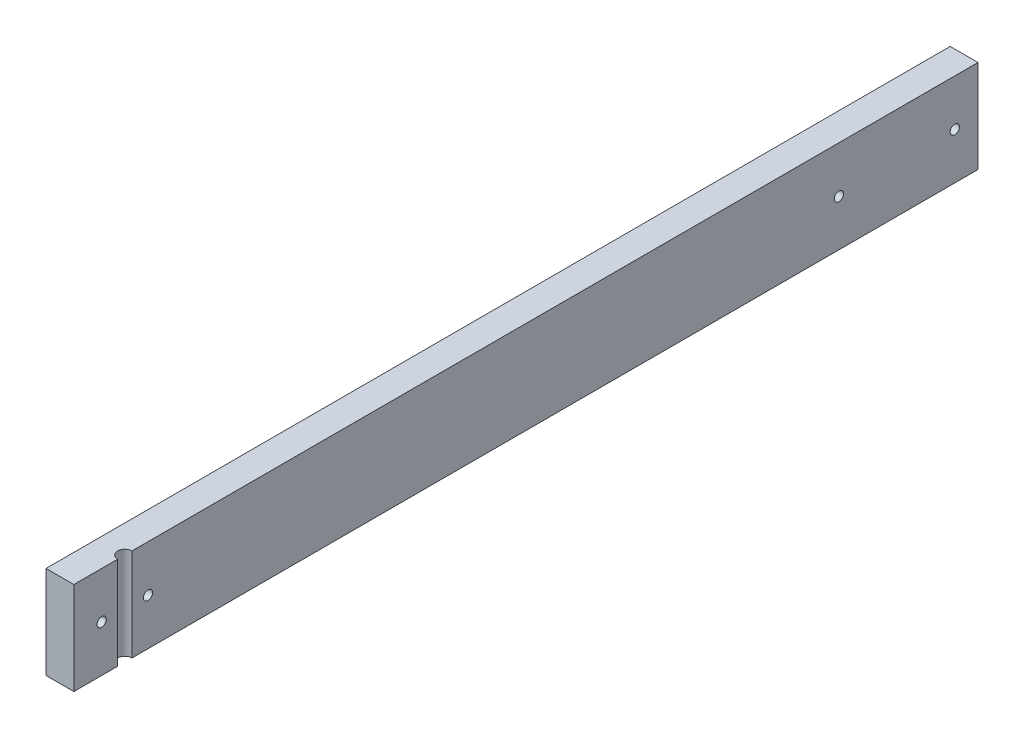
ISO-10303-21;
HEADER;
FILE_DESCRIPTION(('STEP AP214'),'2;1');
FILE_NAME('part.step','',(''),(''),'','','');
FILE_SCHEMA(('AUTOMOTIVE_DESIGN { 1 0 10303 214 1 1 1 1 }'));
ENDSEC;
DATA;
#1=APPLICATION_CONTEXT('core data for automotive mechanical design processes');
#2=APPLICATION_PROTOCOL_DEFINITION('international standard','automotive_design',2000,#1);
#3=PRODUCT_CONTEXT('',#1,'mechanical');
#4=PRODUCT('Part','Part','',(#3));
#5=PRODUCT_RELATED_PRODUCT_CATEGORY('part','',(#4));
#6=PRODUCT_DEFINITION_FORMATION('','',#4);
#7=PRODUCT_DEFINITION_CONTEXT('part definition',#1,'design');
#8=PRODUCT_DEFINITION('design','',#6,#7);
#9=PRODUCT_DEFINITION_SHAPE('','',#8);
#10=(LENGTH_UNIT() NAMED_UNIT(*) SI_UNIT(.MILLI.,.METRE.));
#11=(NAMED_UNIT(*) PLANE_ANGLE_UNIT() SI_UNIT($,.RADIAN.));
#12=(NAMED_UNIT(*) SI_UNIT($,.STERADIAN.) SOLID_ANGLE_UNIT());
#13=UNCERTAINTY_MEASURE_WITH_UNIT(LENGTH_MEASURE(1.E-05),#10,'distance_accuracy_value','');
#14=(GEOMETRIC_REPRESENTATION_CONTEXT(3) GLOBAL_UNCERTAINTY_ASSIGNED_CONTEXT((#13)) GLOBAL_UNIT_ASSIGNED_CONTEXT((#10,
#11,#12)) REPRESENTATION_CONTEXT('',''));
#15=CARTESIAN_POINT('',(0.,0.,0.));
#16=DIRECTION('',(0.,0.,1.));
#17=DIRECTION('',(1.,0.,0.));
#18=AXIS2_PLACEMENT_3D('',#15,#16,#17);
#19=CARTESIAN_POINT('',(6.,20.,0.));
#20=DIRECTION('',(-1.,0.,0.));
#21=DIRECTION('',(0.,0.,1.));
#22=AXIS2_PLACEMENT_3D('',#19,#20,#21);
#23=PLANE('',#22);
#24=CARTESIAN_POINT('',(6.,10.,-6.));
#25=DIRECTION('',(1.,0.,0.));
#26=DIRECTION('',(0.,0.,-1.));
#27=AXIS2_PLACEMENT_3D('',#24,#25,#26);
#28=CIRCLE('',#27,1.);
#29=CARTESIAN_POINT('',(6.,10.,-7.));
#30=VERTEX_POINT('',#29);
#31=EDGE_CURVE('E151',#30,#30,#28,.T.);
#32=ORIENTED_EDGE('',*,*,#31,.F.);
#33=EDGE_LOOP('',(#32));
#34=FACE_BOUND('',#33,.T.);
#35=DIRECTION('',(0.,0.,-1.));
#36=VECTOR('',#35,1.);
#37=CARTESIAN_POINT('',(6.,0.,0.));
#38=LINE('',#37,#36);
#39=CARTESIAN_POINT('',(6.,0.,0.));
#40=VERTEX_POINT('',#39);
#41=CARTESIAN_POINT('',(6.,0.,-9.45));
#42=VERTEX_POINT('',#41);
#43=EDGE_CURVE('E88',#40,#42,#38,.T.);
#44=ORIENTED_EDGE('',*,*,#43,.T.);
#45=DIRECTION('',(0.,1.,0.));
#46=VECTOR('',#45,1.);
#47=CARTESIAN_POINT('',(6.,0.,-9.45));
#48=LINE('',#47,#46);
#49=CARTESIAN_POINT('',(6.,20.,-9.45));
#50=VERTEX_POINT('',#49);
#51=EDGE_CURVE('E81',#42,#50,#48,.T.);
#52=ORIENTED_EDGE('',*,*,#51,.T.);
#53=DIRECTION('',(0.,0.,1.));
#54=VECTOR('',#53,1.);
#55=CARTESIAN_POINT('',(6.,20.,0.));
#56=LINE('',#55,#54);
#57=CARTESIAN_POINT('',(6.,20.,0.));
#58=VERTEX_POINT('',#57);
#59=EDGE_CURVE('E49',#50,#58,#56,.T.);
#60=ORIENTED_EDGE('',*,*,#59,.T.);
#61=DIRECTION('',(0.,-1.,0.));
#62=VECTOR('',#61,1.);
#63=CARTESIAN_POINT('',(6.,0.,0.));
#64=LINE('',#63,#62);
#65=EDGE_CURVE('E120',#58,#40,#64,.T.);
#66=ORIENTED_EDGE('',*,*,#65,.T.);
#67=EDGE_LOOP('',(#44,#52,#60,#66));
#68=FACE_BOUND('',#67,.T.);
#69=ADVANCED_FACE('F26',(#34,#68),#23,.F.);
#70=CARTESIAN_POINT('',(6.,0.,0.));
#71=DIRECTION('',(0.,0.,-1.));
#72=DIRECTION('',(-1.,0.,0.));
#73=AXIS2_PLACEMENT_3D('',#70,#71,#72);
#74=PLANE('',#73);
#75=DIRECTION('',(0.,-1.,0.));
#76=VECTOR('',#75,1.);
#77=CARTESIAN_POINT('',(0.,0.,0.));
#78=LINE('',#77,#76);
#79=CARTESIAN_POINT('',(0.,20.,0.));
#80=VERTEX_POINT('',#79);
#81=CARTESIAN_POINT('',(0.,0.,0.));
#82=VERTEX_POINT('',#81);
#83=EDGE_CURVE('E122',#80,#82,#78,.T.);
#84=ORIENTED_EDGE('',*,*,#83,.T.);
#85=DIRECTION('',(-1.,0.,0.));
#86=VECTOR('',#85,1.);
#87=CARTESIAN_POINT('',(6.,0.,0.));
#88=LINE('',#87,#86);
#89=EDGE_CURVE('E11',#40,#82,#88,.T.);
#90=ORIENTED_EDGE('',*,*,#89,.F.);
#91=ORIENTED_EDGE('',*,*,#65,.F.);
#92=DIRECTION('',(-1.,0.,0.));
#93=VECTOR('',#92,1.);
#94=CARTESIAN_POINT('',(6.,20.,0.));
#95=LINE('',#94,#93);
#96=EDGE_CURVE('E92',#58,#80,#95,.T.);
#97=ORIENTED_EDGE('',*,*,#96,.T.);
#98=EDGE_LOOP('',(#84,#90,#91,#97));
#99=FACE_BOUND('',#98,.T.);
#100=ADVANCED_FACE('F28',(#99),#74,.F.);
#101=CARTESIAN_POINT('',(6.,0.,0.));
#102=DIRECTION('',(0.,1.,0.));
#103=DIRECTION('',(0.,0.,1.));
#104=AXIS2_PLACEMENT_3D('',#101,#102,#103);
#105=PLANE('',#104);
#106=CARTESIAN_POINT('',(6.,0.,-12.55));
#107=VERTEX_POINT('',#106);
#108=CARTESIAN_POINT('',(6.,0.,-195.));
#109=VERTEX_POINT('',#108);
#110=EDGE_CURVE('E126',#107,#109,#38,.T.);
#111=ORIENTED_EDGE('',*,*,#110,.F.);
#112=CARTESIAN_POINT('',(6.,0.,-11.));
#113=DIRECTION('',(0.,1.,0.));
#114=DIRECTION('',(0.,0.,1.));
#115=AXIS2_PLACEMENT_3D('',#112,#113,#114);
#116=CIRCLE('',#115,1.55);
#117=EDGE_CURVE('E41',#107,#42,#116,.T.);
#118=ORIENTED_EDGE('',*,*,#117,.T.);
#119=ORIENTED_EDGE('',*,*,#43,.F.);
#120=ORIENTED_EDGE('',*,*,#89,.T.);
#121=DIRECTION('',(0.,0.,-1.));
#122=VECTOR('',#121,1.);
#123=CARTESIAN_POINT('',(0.,0.,0.));
#124=LINE('',#123,#122);
#125=CARTESIAN_POINT('',(0.,0.,-195.));
#126=VERTEX_POINT('',#125);
#127=EDGE_CURVE('E117',#82,#126,#124,.T.);
#128=ORIENTED_EDGE('',*,*,#127,.T.);
#129=DIRECTION('',(-1.,0.,0.));
#130=VECTOR('',#129,1.);
#131=CARTESIAN_POINT('',(6.,0.,-195.));
#132=LINE('',#131,#130);
#133=EDGE_CURVE('E34',#109,#126,#132,.T.);
#134=ORIENTED_EDGE('',*,*,#133,.F.);
#135=EDGE_LOOP('',(#111,#118,#119,#120,#128,#134));
#136=FACE_BOUND('',#135,.T.);
#137=ADVANCED_FACE('F129',(#136),#105,.F.);
#138=CARTESIAN_POINT('',(6.,0.,-195.));
#139=DIRECTION('',(0.,0.,1.));
#140=DIRECTION('',(1.,0.,0.));
#141=AXIS2_PLACEMENT_3D('',#138,#139,#140);
#142=PLANE('',#141);
#143=DIRECTION('',(0.,1.,0.));
#144=VECTOR('',#143,1.);
#145=CARTESIAN_POINT('',(0.,0.,-195.));
#146=LINE('',#145,#144);
#147=CARTESIAN_POINT('',(0.,20.,-195.));
#148=VERTEX_POINT('',#147);
#149=EDGE_CURVE('E110',#126,#148,#146,.T.);
#150=ORIENTED_EDGE('',*,*,#149,.T.);
#151=DIRECTION('',(-1.,0.,0.));
#152=VECTOR('',#151,1.);
#153=CARTESIAN_POINT('',(6.,20.,-195.));
#154=LINE('',#153,#152);
#155=CARTESIAN_POINT('',(6.,20.,-195.));
#156=VERTEX_POINT('',#155);
#157=EDGE_CURVE('E101',#156,#148,#154,.T.);
#158=ORIENTED_EDGE('',*,*,#157,.F.);
#159=DIRECTION('',(0.,1.,0.));
#160=VECTOR('',#159,1.);
#161=CARTESIAN_POINT('',(6.,0.,-195.));
#162=LINE('',#161,#160);
#163=EDGE_CURVE('E95',#109,#156,#162,.T.);
#164=ORIENTED_EDGE('',*,*,#163,.F.);
#165=ORIENTED_EDGE('',*,*,#133,.T.);
#166=EDGE_LOOP('',(#150,#158,#164,#165));
#167=FACE_BOUND('',#166,.T.);
#168=ADVANCED_FACE('F108',(#167),#142,.F.);
#169=CARTESIAN_POINT('',(6.,20.,0.));
#170=DIRECTION('',(0.,-1.,0.));
#171=DIRECTION('',(0.,0.,-1.));
#172=AXIS2_PLACEMENT_3D('',#169,#170,#171);
#173=PLANE('',#172);
#174=ORIENTED_EDGE('',*,*,#59,.F.);
#175=CARTESIAN_POINT('',(6.,20.,-11.));
#176=DIRECTION('',(0.,1.,0.));
#177=DIRECTION('',(0.,0.,1.));
#178=AXIS2_PLACEMENT_3D('',#175,#176,#177);
#179=CIRCLE('',#178,1.55);
#180=CARTESIAN_POINT('',(6.,20.,-12.55));
#181=VERTEX_POINT('',#180);
#182=EDGE_CURVE('E79',#181,#50,#179,.T.);
#183=ORIENTED_EDGE('',*,*,#182,.F.);
#184=EDGE_CURVE('E94',#156,#181,#56,.T.);
#185=ORIENTED_EDGE('',*,*,#184,.F.);
#186=ORIENTED_EDGE('',*,*,#157,.T.);
#187=DIRECTION('',(0.,0.,1.));
#188=VECTOR('',#187,1.);
#189=CARTESIAN_POINT('',(0.,20.,0.));
#190=LINE('',#189,#188);
#191=EDGE_CURVE('E118',#148,#80,#190,.T.);
#192=ORIENTED_EDGE('',*,*,#191,.T.);
#193=ORIENTED_EDGE('',*,*,#96,.F.);
#194=EDGE_LOOP('',(#174,#183,#185,#186,#192,#193));
#195=FACE_BOUND('',#194,.T.);
#196=ADVANCED_FACE('F90',(#195),#173,.F.);
#197=CARTESIAN_POINT('',(6.,10.,-190.));
#198=DIRECTION('',(1.,0.,0.));
#199=DIRECTION('',(0.,0.,-1.));
#200=AXIS2_PLACEMENT_3D('',#197,#198,#199);
#201=CIRCLE('',#200,0.999999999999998);
#202=CARTESIAN_POINT('',(6.,10.,-191.));
#203=VERTEX_POINT('',#202);
#204=EDGE_CURVE('E132',#203,#203,#201,.T.);
#205=ORIENTED_EDGE('',*,*,#204,.F.);
#206=EDGE_LOOP('',(#205));
#207=FACE_BOUND('',#206,.T.);
#208=CARTESIAN_POINT('',(6.,10.,-165.));
#209=DIRECTION('',(1.,0.,0.));
#210=DIRECTION('',(0.,0.,-1.));
#211=AXIS2_PLACEMENT_3D('',#208,#209,#210);
#212=CIRCLE('',#211,0.999999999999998);
#213=CARTESIAN_POINT('',(6.,10.,-166.));
#214=VERTEX_POINT('',#213);
#215=EDGE_CURVE('E139',#214,#214,#212,.T.);
#216=ORIENTED_EDGE('',*,*,#215,.F.);
#217=EDGE_LOOP('',(#216));
#218=FACE_BOUND('',#217,.T.);
#219=CARTESIAN_POINT('',(6.,10.,-16.));
#220=DIRECTION('',(1.,0.,0.));
#221=DIRECTION('',(0.,0.,-1.));
#222=AXIS2_PLACEMENT_3D('',#219,#220,#221);
#223=CIRCLE('',#222,1.);
#224=CARTESIAN_POINT('',(6.,10.,-17.));
#225=VERTEX_POINT('',#224);
#226=EDGE_CURVE('E145',#225,#225,#223,.T.);
#227=ORIENTED_EDGE('',*,*,#226,.F.);
#228=EDGE_LOOP('',(#227));
#229=FACE_BOUND('',#228,.T.);
#230=ORIENTED_EDGE('',*,*,#184,.T.);
#231=DIRECTION('',(0.,1.,0.));
#232=VECTOR('',#231,1.);
#233=CARTESIAN_POINT('',(6.,0.,-12.55));
#234=LINE('',#233,#232);
#235=EDGE_CURVE('E82',#107,#181,#234,.T.);
#236=ORIENTED_EDGE('',*,*,#235,.F.);
#237=ORIENTED_EDGE('',*,*,#110,.T.);
#238=ORIENTED_EDGE('',*,*,#163,.T.);
#239=EDGE_LOOP('',(#230,#236,#237,#238));
#240=FACE_BOUND('',#239,.T.);
#241=ADVANCED_FACE('F128',(#207,#218,#229,#240),#23,.F.);
#242=CARTESIAN_POINT('',(0.,20.,0.));
#243=DIRECTION('',(-1.,0.,0.));
#244=DIRECTION('',(0.,0.,1.));
#245=AXIS2_PLACEMENT_3D('',#242,#243,#244);
#246=PLANE('',#245);
#247=ORIENTED_EDGE('',*,*,#83,.F.);
#248=ORIENTED_EDGE('',*,*,#191,.F.);
#249=ORIENTED_EDGE('',*,*,#149,.F.);
#250=ORIENTED_EDGE('',*,*,#127,.F.);
#251=EDGE_LOOP('',(#247,#248,#249,#250));
#252=FACE_BOUND('',#251,.T.);
#253=ADVANCED_FACE('F116',(#252),#246,.T.);
#254=CARTESIAN_POINT('',(4.,10.,-6.));
#255=DIRECTION('',(1.,0.,0.));
#256=DIRECTION('',(0.,0.,-1.));
#257=AXIS2_PLACEMENT_3D('',#254,#255,#256);
#258=CYLINDRICAL_SURFACE('',#257,1.);
#259=CARTESIAN_POINT('',(4.,10.,-6.));
#260=DIRECTION('',(1.,0.,0.));
#261=DIRECTION('',(0.,0.,-1.));
#262=AXIS2_PLACEMENT_3D('',#259,#260,#261);
#263=CIRCLE('',#262,1.);
#264=CARTESIAN_POINT('',(4.,10.,-7.));
#265=VERTEX_POINT('',#264);
#266=EDGE_CURVE('E154',#265,#265,#263,.T.);
#267=ORIENTED_EDGE('',*,*,#266,.F.);
#268=EDGE_LOOP('',(#267));
#269=FACE_BOUND('',#268,.T.);
#270=ORIENTED_EDGE('',*,*,#31,.T.);
#271=EDGE_LOOP('',(#270));
#272=FACE_BOUND('',#271,.T.);
#273=ADVANCED_FACE('F180',(#269,#272),#258,.F.);
#274=CARTESIAN_POINT('',(4.,10.,-6.));
#275=DIRECTION('',(1.,0.,0.));
#276=DIRECTION('',(0.,0.,-1.));
#277=AXIS2_PLACEMENT_3D('',#274,#275,#276);
#278=PLANE('',#277);
#279=ORIENTED_EDGE('',*,*,#266,.T.);
#280=EDGE_LOOP('',(#279));
#281=FACE_BOUND('',#280,.T.);
#282=ADVANCED_FACE('F190',(#281),#278,.T.);
#283=CARTESIAN_POINT('',(4.,10.,-16.));
#284=DIRECTION('',(1.,0.,0.));
#285=DIRECTION('',(0.,0.,-1.));
#286=AXIS2_PLACEMENT_3D('',#283,#284,#285);
#287=CYLINDRICAL_SURFACE('',#286,1.);
#288=CARTESIAN_POINT('',(4.,10.,-16.));
#289=DIRECTION('',(1.,0.,0.));
#290=DIRECTION('',(0.,0.,-1.));
#291=AXIS2_PLACEMENT_3D('',#288,#289,#290);
#292=CIRCLE('',#291,1.);
#293=CARTESIAN_POINT('',(4.,10.,-17.));
#294=VERTEX_POINT('',#293);
#295=EDGE_CURVE('E148',#294,#294,#292,.T.);
#296=ORIENTED_EDGE('',*,*,#295,.F.);
#297=EDGE_LOOP('',(#296));
#298=FACE_BOUND('',#297,.T.);
#299=ORIENTED_EDGE('',*,*,#226,.T.);
#300=EDGE_LOOP('',(#299));
#301=FACE_BOUND('',#300,.T.);
#302=ADVANCED_FACE('F187',(#298,#301),#287,.F.);
#303=CARTESIAN_POINT('',(4.,10.,-16.));
#304=DIRECTION('',(1.,0.,0.));
#305=DIRECTION('',(0.,0.,-1.));
#306=AXIS2_PLACEMENT_3D('',#303,#304,#305);
#307=PLANE('',#306);
#308=ORIENTED_EDGE('',*,*,#295,.T.);
#309=EDGE_LOOP('',(#308));
#310=FACE_BOUND('',#309,.T.);
#311=ADVANCED_FACE('F189',(#310),#307,.T.);
#312=CARTESIAN_POINT('',(4.,10.,-165.));
#313=DIRECTION('',(1.,0.,0.));
#314=DIRECTION('',(0.,0.,-1.));
#315=AXIS2_PLACEMENT_3D('',#312,#313,#314);
#316=CYLINDRICAL_SURFACE('',#315,0.999999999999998);
#317=CARTESIAN_POINT('',(4.,10.,-165.));
#318=DIRECTION('',(1.,0.,0.));
#319=DIRECTION('',(0.,0.,-1.));
#320=AXIS2_PLACEMENT_3D('',#317,#318,#319);
#321=CIRCLE('',#320,0.999999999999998);
#322=CARTESIAN_POINT('',(4.,10.,-166.));
#323=VERTEX_POINT('',#322);
#324=EDGE_CURVE('E142',#323,#323,#321,.T.);
#325=ORIENTED_EDGE('',*,*,#324,.F.);
#326=EDGE_LOOP('',(#325));
#327=FACE_BOUND('',#326,.T.);
#328=ORIENTED_EDGE('',*,*,#215,.T.);
#329=EDGE_LOOP('',(#328));
#330=FACE_BOUND('',#329,.T.);
#331=ADVANCED_FACE('F197',(#327,#330),#316,.F.);
#332=CARTESIAN_POINT('',(4.,10.,-165.));
#333=DIRECTION('',(1.,0.,0.));
#334=DIRECTION('',(0.,0.,-1.));
#335=AXIS2_PLACEMENT_3D('',#332,#333,#334);
#336=PLANE('',#335);
#337=ORIENTED_EDGE('',*,*,#324,.T.);
#338=EDGE_LOOP('',(#337));
#339=FACE_BOUND('',#338,.T.);
#340=ADVANCED_FACE('F230',(#339),#336,.T.);
#341=CARTESIAN_POINT('',(4.,10.,-190.));
#342=DIRECTION('',(1.,0.,0.));
#343=DIRECTION('',(0.,0.,-1.));
#344=AXIS2_PLACEMENT_3D('',#341,#342,#343);
#345=CYLINDRICAL_SURFACE('',#344,0.999999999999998);
#346=CARTESIAN_POINT('',(4.,10.,-190.));
#347=DIRECTION('',(1.,0.,0.));
#348=DIRECTION('',(0.,0.,-1.));
#349=AXIS2_PLACEMENT_3D('',#346,#347,#348);
#350=CIRCLE('',#349,0.999999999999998);
#351=CARTESIAN_POINT('',(4.,10.,-191.));
#352=VERTEX_POINT('',#351);
#353=EDGE_CURVE('E136',#352,#352,#350,.T.);
#354=ORIENTED_EDGE('',*,*,#353,.F.);
#355=EDGE_LOOP('',(#354));
#356=FACE_BOUND('',#355,.T.);
#357=ORIENTED_EDGE('',*,*,#204,.T.);
#358=EDGE_LOOP('',(#357));
#359=FACE_BOUND('',#358,.T.);
#360=ADVANCED_FACE('F237',(#356,#359),#345,.F.);
#361=CARTESIAN_POINT('',(4.,10.,-190.));
#362=DIRECTION('',(1.,0.,0.));
#363=DIRECTION('',(0.,0.,-1.));
#364=AXIS2_PLACEMENT_3D('',#361,#362,#363);
#365=PLANE('',#364);
#366=ORIENTED_EDGE('',*,*,#353,.T.);
#367=EDGE_LOOP('',(#366));
#368=FACE_BOUND('',#367,.T.);
#369=ADVANCED_FACE('F245',(#368),#365,.T.);
#370=CARTESIAN_POINT('',(6.,0.,-11.));
#371=DIRECTION('',(0.,1.,0.));
#372=DIRECTION('',(0.,0.,1.));
#373=AXIS2_PLACEMENT_3D('',#370,#371,#372);
#374=CYLINDRICAL_SURFACE('',#373,1.55);
#375=ORIENTED_EDGE('',*,*,#182,.T.);
#376=ORIENTED_EDGE('',*,*,#51,.F.);
#377=ORIENTED_EDGE('',*,*,#117,.F.);
#378=ORIENTED_EDGE('',*,*,#235,.T.);
#379=EDGE_LOOP('',(#375,#376,#377,#378));
#380=FACE_BOUND('',#379,.T.);
#381=ADVANCED_FACE('F80',(#380),#374,.F.);
#382=CLOSED_SHELL('',(#69,#100,#137,#168,#196,#241,#253,#273,#282,#302,#311,#331,#340,#360,#369,#381));
#383=MANIFOLD_SOLID_BREP('B2',#382);
#384=ADVANCED_BREP_SHAPE_REPRESENTATION('',(#18,#383),#14);
#385=SHAPE_DEFINITION_REPRESENTATION(#9,#384);
ENDSEC;
END-ISO-10303-21;
